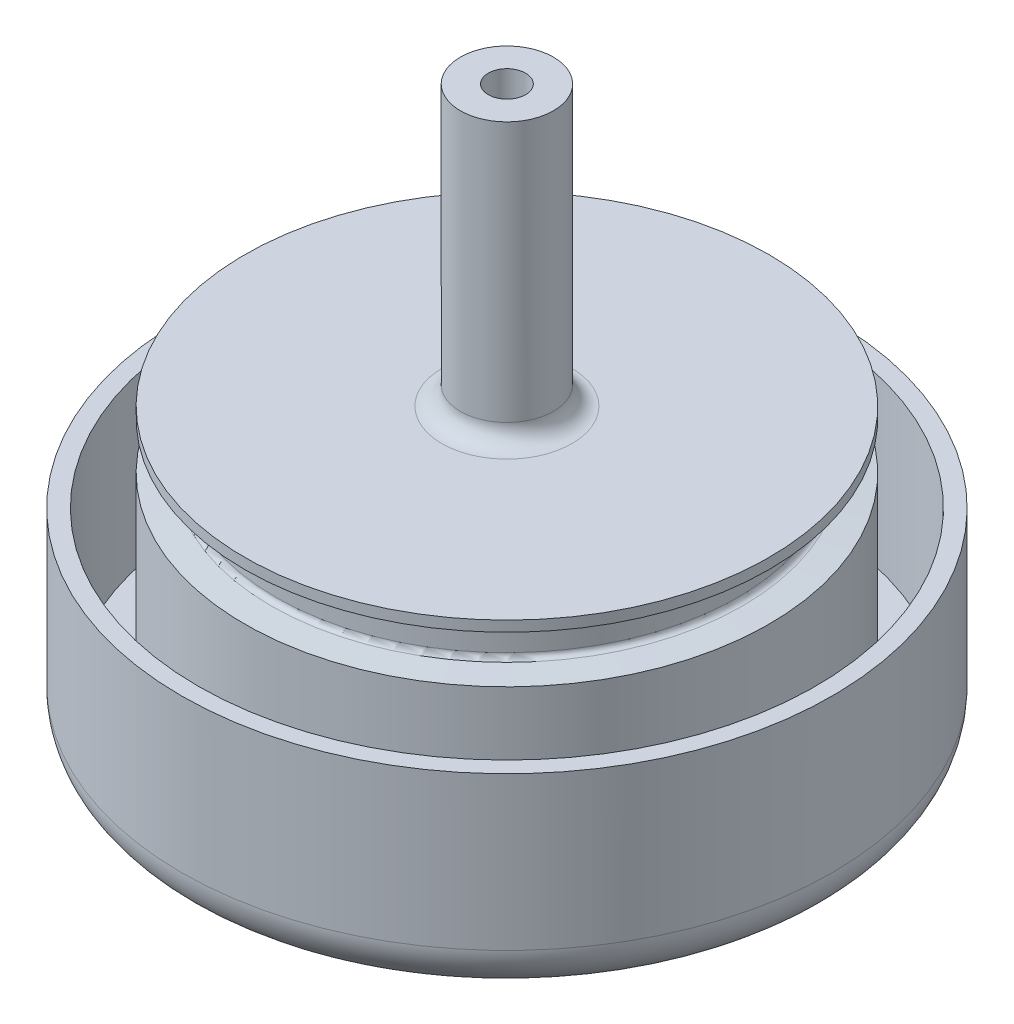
from build123d import *

# Parameters (mm, degrees)
SKETCH1_R                   = 35.814
EXTRUDE1_DEPTH              = 9.525
SKETCH9_R                   = 6.35
EXTRUDE2_DEPTH              = 38.1
FILLET1_R                   = 2.54
F_1_4_20_TAPPED_HOLE1_D     = 5.1054
F_1_4_20_TAPPED_HOLE1_DEPTH = 16.002
F_1_4_20_TAPPED_HOLE1_TIP   = 1.533816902
FILLET2_R                   = 6.35


with BuildPart() as part:
    # Sketch1 → Extrude1 (new body)
    with BuildSketch(Plane(origin=(0, 0, 0), x_dir=(1, 0, 0), z_dir=(0, 1, 0))):
        with Locations(Location((0, 0, 0), (0, 0, 90))):
            Circle(SKETCH1_R)
    extrude(amount=EXTRUDE1_DEPTH)

    # Sketch9 → Extrude2 (add)
    with BuildSketch(Plane(origin=(0, 9.525, 0), x_dir=(1, 0, 0), z_dir=(0, 1, 0))):
        with Locations(Location((0, 0, 0), (0, 0, 90))):
            Circle(SKETCH9_R)
    extrude(amount=EXTRUDE2_DEPTH)

    # Sketch13 → Groove for AS 568-334_ O-Ring1 (revolve, cut)
    with BuildSketch(Plane(origin=(0, 9.525, 0), x_dir=(0, 0, -1), z_dir=(-1, 0, 0)), mode=Mode.PRIVATE) as groove_for_as_568_334_o_ring1_sk:
        with BuildLine():
            Line((32.171721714, 7.57345355), (37.0586, 8.001))
            Line((37.0586, 8.001), (37.0586, 1.3293071))
            Line((37.0586, 1.3293071), (32.171721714, 1.75685355))
            ThreePointArc((32.171721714, 1.75685355), (31.71761178, 1.980795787), (31.5341, 2.452695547))
            Line((31.5341, 2.452695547), (31.5341, 6.877611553))
            ThreePointArc((31.5341, 6.877611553), (31.71761178, 7.349511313), (32.171721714, 7.57345355))
        make_face()
    revolve(groove_for_as_568_334_o_ring1_sk.sketch.rotate(Axis((0, -40.475, 0), (0, 1, 0)), 180), axis=Axis((0, -40.475, 0), (0, 1, 0)), mode=Mode.SUBTRACT)

    # Fillet1
    fillet1_edges = [part.edges().sort_by_distance(p)[0] for p in [
        (0, 9.525, 6.35),
    ]]
    fillet(fillet1_edges, radius=FILLET1_R)

    # 1_4-20 Tapped Hole1
    with Locations(Plane.ZX.offset(47.625)):
        with Locations((0, 0)):
            Hole(F_1_4_20_TAPPED_HOLE1_D / 2, depth=F_1_4_20_TAPPED_HOLE1_DEPTH)
            with Locations((0, 0, -(F_1_4_20_TAPPED_HOLE1_DEPTH + F_1_4_20_TAPPED_HOLE1_TIP / 2))):  # 118° drill point
                Cone(0, F_1_4_20_TAPPED_HOLE1_D / 2, F_1_4_20_TAPPED_HOLE1_TIP, mode=Mode.SUBTRACT)

    # Sketch24 → Revolve2 (revolve)
    with BuildSketch(Plane.XY, mode=Mode.PRIVATE) as revolve2_sk:
        Polygon((35.814, 0), (35.814, -25.4), (42.164, -25.4), (42.164, -2.54), (44.45, -2.54), (44.45, -28.575), (0, -38.1), (0, 0), align=None)
    revolve(revolve2_sk.sketch.rotate(Axis((0, 0, 0), (0, 1, 0)), 270), axis=Axis((0, 0, 0), (0, 1, 0)))

    # Fillet2
    fillet2_edges = [part.edges().sort_by_distance(p)[0] for p in [
        (0, -28.575, -44.45),
    ]]
    fillet(fillet2_edges, radius=FILLET2_R)


solid = part.part
